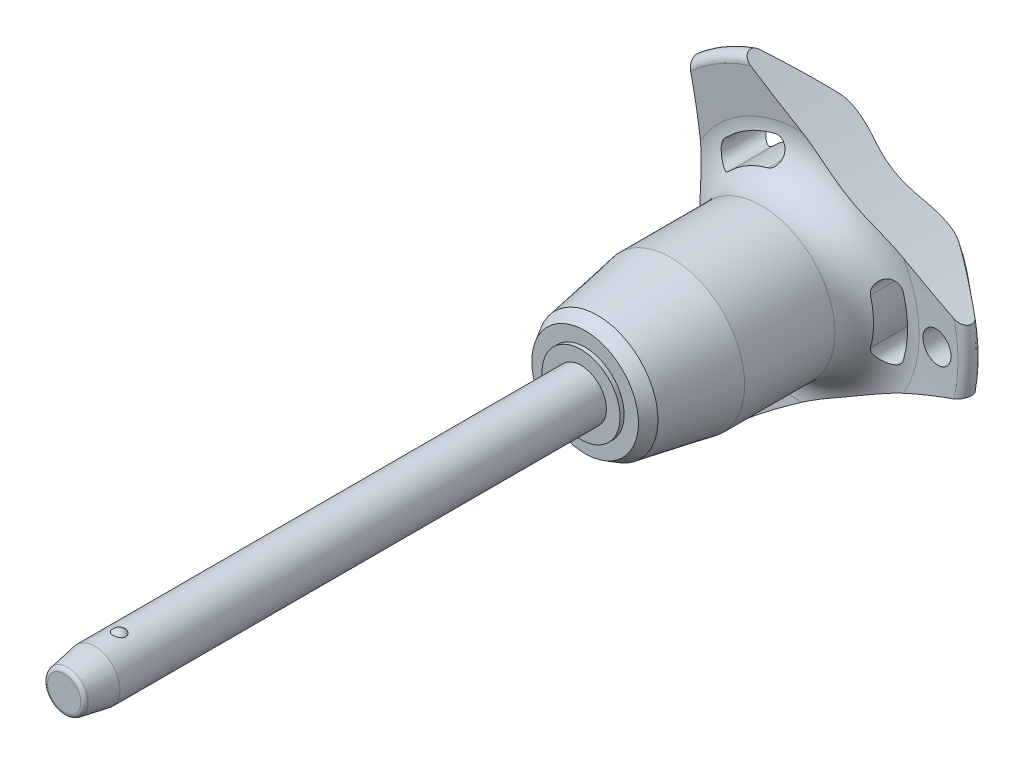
from build123d import *

# Parameters (mm, degrees)
SKETCH1_R           = 2.5
BOSS_EXTRUDE1_DEPTH = 45
SKETCH2_R           = 2.1
BOSS_EXTRUDE2_DEPTH = 26.7
BOSS_EXTRUDE3_START = 6
SKETCH1_2_R         = 2.5
BOSS_EXTRUDE3_DEPTH = 6
CHAMFER1_SIZE       = 3
CHAMFER1_SIZE2      = 0.528980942
FILLET1_R           = 0.4
SKETCH6_R           = 79.96
CUT_EXTRUDE1_DEPTH  = 76.446116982
CIRPATTERN1_COUNT   = 3
SKETCH7_R           = 1.5
CUT_EXTRUDE2_DEPTH  = 76.244100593


with BuildPart() as part:
    # Sketch1 → Boss-Extrude1 (new body)
    with BuildSketch(Plane.XY):
        Circle(SKETCH1_R)
    extrude(amount=-BOSS_EXTRUDE1_DEPTH)

    # Sketch2 → Boss-Extrude2 (add)
    with BuildSketch(Plane(origin=(0, 0, -45), x_dir=(-1, 0, 0), z_dir=(0, 0, -1))):
        Circle(SKETCH2_R)
    extrude(amount=BOSS_EXTRUDE2_DEPTH)

    # Sketch3 → Revolve1 (revolve)
    with BuildSketch(Plane(origin=(0, 0, 0), x_dir=(0, 0, -1), z_dir=(1, 0, 0))):
        with BuildLine():
            Line((-0.580947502, 2.75), (-0.580947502, 1.15))
            ThreePointArc((-0.580947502, 1.15), (0.219052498, 1.95), (-0.580947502, 2.75))
        make_face()
        with BuildLine():
            Line((-0.580947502, -1.15), (-0.580947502, -2.75))
            ThreePointArc((-0.580947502, -2.75), (0.219052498, -1.95), (-0.580947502, -1.15))
        make_face()
    revolve(axis=Axis((0, -1.15, 0.580947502), (0, 1, 0)))

    # Sketch1_2 → Boss-Extrude3 (add)
    with BuildSketch(Plane.XY.offset(BOSS_EXTRUDE3_START)):
        Circle(SKETCH1_2_R)
    extrude(amount=-BOSS_EXTRUDE3_DEPTH)

    # Chamfer1
    chamfer1_edges = [part.edges().sort_by_distance(p)[0] for p in [
        (-2.5, 0, 6),
    ]]
    chamfer1_side = [part.faces().sort_by_distance(p)[0] for p in [
        (-2.5, 0, -19.5),
    ]]
    chamfer(chamfer1_edges, length=CHAMFER1_SIZE, length2=CHAMFER1_SIZE2, reference=chamfer1_side[0])

    # Fillet1
    fillet1_edges = [part.edges().sort_by_distance(p)[0] for p in [
        (-1.971019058, 0, 6),
        (2.1, 0, -71.7),
    ]]
    fillet(fillet1_edges, radius=FILLET1_R)

    # Sketch4 → Revolve2 (revolve)
    with BuildSketch(Plane(origin=(0, 0, 0), x_dir=(0, 0, -1), z_dir=(1, 0, 0)), mode=Mode.PRIVATE) as revolve2_sk:
        Polygon((45, 0), (45, 3.851837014), (45.4, 3.851837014), (45.4, 5.26161122), (46.620900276, 5.966498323), (53.9, 7.25), (62.8, 7.25), (62.8, 0), align=None)
    revolve(revolve2_sk.sketch.rotate(Axis((0, 0, -62.8), (0, 0, 1)), 90), axis=Axis((0, 0, -62.8), (0, 0, 1)))

    # Sketch5 → Revolve3 (revolve)
    with BuildSketch(Plane(origin=(0, 0, 0), x_dir=(0, 0, -1), z_dir=(1, 0, 0)), mode=Mode.PRIVATE) as revolve3_sk:
        with BuildLine():
            Line((66.78715932, 11.570250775), (66.452568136, 15.735949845))
            ThreePointArc((66.452568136, 15.735949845), (66.946485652, 16.540188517), (67.862835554, 16.314230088))
            Line((67.862835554, 16.314230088), (71.326414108, 12.186497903))
            ThreePointArc((71.326414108, 12.186497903), (71.7, 11.109282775), (71.261488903, 10.056825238))
            ThreePointArc((71.261488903, 10.056825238), (68.289873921, 5.413681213), (67.25, 0))
            Line((67.25, 0), (62.8, 0))
            Line((62.8, 0), (62.8, 7.25))
            ThreePointArc((62.8, 7.25), (65.739473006, 8.537160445), (66.78715932, 11.570250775))
        make_face()
    revolve(revolve3_sk.sketch.rotate(Axis((0, 0, -67.25), (0, 0, 1)), 90), axis=Axis((0, 0, -67.25), (0, 0, 1)))

    # Sketch6 → Cut-Extrude1 (cut, through all)
    with BuildSketch(Plane.XY):
        with Locations((-89.76, 0)):
            Circle(SKETCH6_R)
        with BuildLine():
            ThreePointArc((10.099921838, -2.834717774), (10.490188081, 0), (10.099921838, 2.834717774))
            ThreePointArc((10.099921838, 2.834717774), (8.768180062, 3.582738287), (8.020159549, 2.250996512))
            ThreePointArc((8.020159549, 2.250996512), (8.330062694, 0), (8.020159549, -2.250996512))
            ThreePointArc((8.020159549, -2.250996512), (8.768180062, -3.582738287), (10.099921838, -2.834717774))
        make_face()
    cut_extrude1 = extrude(amount=-CUT_EXTRUDE1_DEPTH, mode=Mode.SUBTRACT)

    # CirPattern1: Cut-Extrude1 ×3 about axis
    cirpattern1_axis = Axis((0, 0, 0), (0, 0, 1))
    for i in range(1, CIRPATTERN1_COUNT):
        add(cut_extrude1.rotate(cirpattern1_axis, i * 360 / CIRPATTERN1_COUNT), mode=Mode.SUBTRACT)

    # Sketch7 → Cut-Extrude2 (cut, through all)
    with BuildSketch(Plane.XY):
        with Locations(Location((13.490188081, 0, 0), (0, 0, 225.221865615))):
            Circle(SKETCH7_R)
    extrude(amount=-CUT_EXTRUDE2_DEPTH, mode=Mode.SUBTRACT)


solid = part.part
